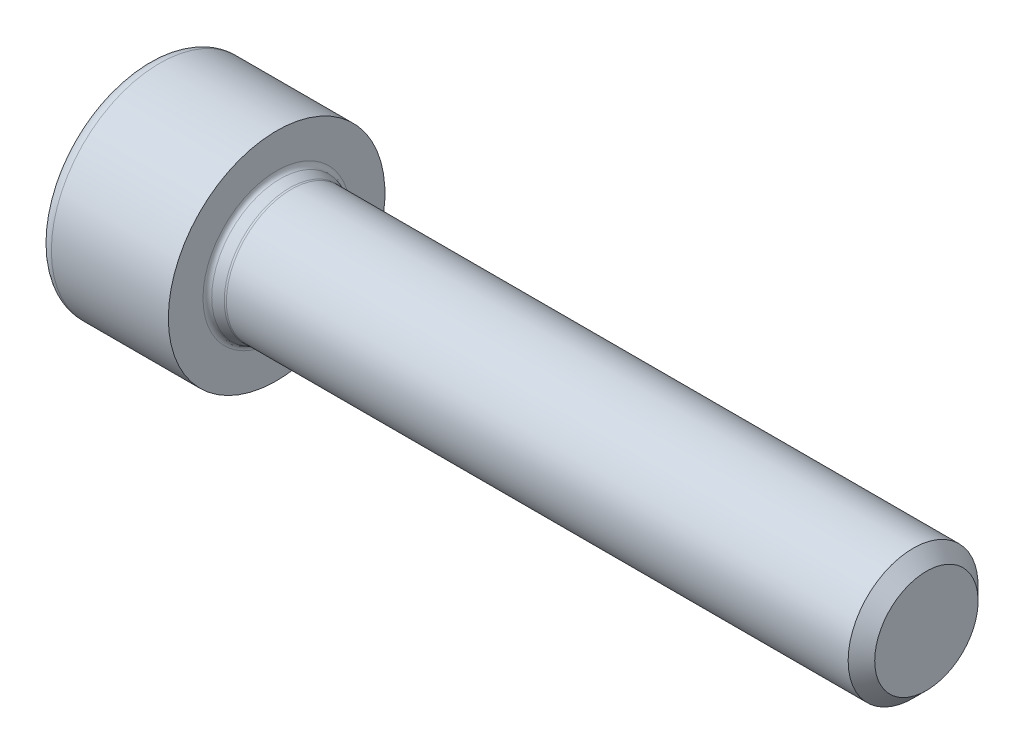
ISO-10303-21;
HEADER;
FILE_DESCRIPTION(('STEP AP214'),'2;1');
FILE_NAME('part.step','',(''),(''),'','','');
FILE_SCHEMA(('AUTOMOTIVE_DESIGN { 1 0 10303 214 1 1 1 1 }'));
ENDSEC;
DATA;
#1=APPLICATION_CONTEXT('core data for automotive mechanical design processes');
#2=APPLICATION_PROTOCOL_DEFINITION('international standard','automotive_design',2000,#1);
#3=PRODUCT_CONTEXT('',#1,'mechanical');
#4=PRODUCT('Part','Part','',(#3));
#5=PRODUCT_RELATED_PRODUCT_CATEGORY('part','',(#4));
#6=PRODUCT_DEFINITION_FORMATION('','',#4);
#7=PRODUCT_DEFINITION_CONTEXT('part definition',#1,'design');
#8=PRODUCT_DEFINITION('design','',#6,#7);
#9=PRODUCT_DEFINITION_SHAPE('','',#8);
#10=(LENGTH_UNIT() NAMED_UNIT(*) SI_UNIT(.MILLI.,.METRE.));
#11=(NAMED_UNIT(*) PLANE_ANGLE_UNIT() SI_UNIT($,.RADIAN.));
#12=(NAMED_UNIT(*) SI_UNIT($,.STERADIAN.) SOLID_ANGLE_UNIT());
#13=UNCERTAINTY_MEASURE_WITH_UNIT(LENGTH_MEASURE(1.E-05),#10,'distance_accuracy_value','');
#14=(GEOMETRIC_REPRESENTATION_CONTEXT(3) GLOBAL_UNCERTAINTY_ASSIGNED_CONTEXT((#13)) GLOBAL_UNIT_ASSIGNED_CONTEXT((#10,
#11,#12)) REPRESENTATION_CONTEXT('',''));
#15=CARTESIAN_POINT('',(0.,0.,0.));
#16=DIRECTION('',(0.,0.,1.));
#17=DIRECTION('',(1.,0.,0.));
#18=AXIS2_PLACEMENT_3D('',#15,#16,#17);
#19=CARTESIAN_POINT('',(-6.,0.,0.));
#20=DIRECTION('',(-1.,0.,0.));
#21=DIRECTION('',(0.,0.,1.));
#22=AXIS2_PLACEMENT_3D('',#19,#20,#21);
#23=CONICAL_SURFACE('',#22,2.86000000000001,0.785398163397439);
#24=CARTESIAN_POINT('',(-6.,0.,0.));
#25=DIRECTION('',(-1.,0.,0.));
#26=DIRECTION('',(0.,0.,1.));
#27=AXIS2_PLACEMENT_3D('',#24,#25,#26);
#28=CIRCLE('',#27,2.86000000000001);
#29=CARTESIAN_POINT('',(-6.,1.47051329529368,2.45299625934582));
#30=VERTEX_POINT('',#29);
#31=CARTESIAN_POINT('',(-6.,2.85961372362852,0.0470037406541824));
#32=VERTEX_POINT('',#31);
#33=EDGE_CURVE('E277',#30,#32,#28,.T.);
#34=ORIENTED_EDGE('',*,*,#33,.T.);
#35=CARTESIAN_POINT('',(-6.0002,2.85981958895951,0.0466471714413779));
#36=CARTESIAN_POINT('',(-5.9535581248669,2.8117797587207,0.129854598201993));
#37=CARTESIAN_POINT('',(-5.90977996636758,2.76295285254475,0.214425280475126));
#38=CARTESIAN_POINT('',(-5.82984876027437,2.66348007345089,0.386717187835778));
#39=CARTESIAN_POINT('',(-5.79373670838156,2.61282603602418,0.474452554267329));
#40=CARTESIAN_POINT('',(-5.73201914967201,2.51070463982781,0.651332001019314));
#41=CARTESIAN_POINT('',(-5.70626836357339,2.45925985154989,0.740436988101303));
#42=CARTESIAN_POINT('',(-5.66674232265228,2.35531480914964,0.920475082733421));
#43=CARTESIAN_POINT('',(-5.65294024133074,2.30281719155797,1.01140362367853));
#44=CARTESIAN_POINT('',(-5.64046950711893,2.21102353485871,1.17039490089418));
#45=CARTESIAN_POINT('',(-5.63880967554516,2.17182546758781,1.23828794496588));
#46=CARTESIAN_POINT('',(-5.6428692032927,2.09351034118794,1.37393372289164));
#47=CARTESIAN_POINT('',(-5.64859105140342,2.05439331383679,1.44168640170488));
#48=CARTESIAN_POINT('',(-5.66708669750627,1.9765471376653,1.57651993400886));
#49=CARTESIAN_POINT('',(-5.67986731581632,1.93781840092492,1.64360007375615));
#50=CARTESIAN_POINT('',(-5.71178546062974,1.86103794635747,1.77658772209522));
#51=CARTESIAN_POINT('',(-5.73092243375,1.82298616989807,1.84249533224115));
#52=CARTESIAN_POINT('',(-5.78438808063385,1.73101321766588,2.00179715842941));
#53=CARTESIAN_POINT('',(-5.82169163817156,1.67752371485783,2.09444369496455));
#54=CARTESIAN_POINT('',(-5.88419452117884,1.59873239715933,2.23091426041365));
#55=CARTESIAN_POINT('',(-5.90608259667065,1.57274677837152,2.27592267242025));
#56=CARTESIAN_POINT('',(-5.95177212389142,1.52121042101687,2.36518626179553));
#57=CARTESIAN_POINT('',(-5.9755728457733,1.49565952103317,2.40944171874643));
#58=CARTESIAN_POINT('',(-6.00020000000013,1.47030742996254,2.45335282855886));
#59=B_SPLINE_CURVE_WITH_KNOTS('',3,(#35,#36,#37,#38,#39,#40,#41,#42,#43,#44,#45,#46,#47,#48,#49,
#50,#51,#52,#53,#54,#55,#56,#57,#58),.UNSPECIFIED.,.F.,.F.,(4,2,2,2,2,2,2,2,2,2,2,4),(0.,
0.320611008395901,0.642895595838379,0.960489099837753,1.2773676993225,1.51227477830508,
1.74726107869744,1.98247482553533,2.21766810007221,2.55697541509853,2.72612555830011,
2.89521145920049),.UNSPECIFIED.);
#60=EDGE_CURVE('E242',#32,#30,#59,.T.);
#61=ORIENTED_EDGE('',*,*,#60,.T.);
#62=EDGE_LOOP('',(#34,#61));
#63=FACE_BOUND('',#62,.T.);
#64=ADVANCED_FACE('F32',(#63),#23,.F.);
#65=CARTESIAN_POINT('',(-6.,2.85961372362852,-0.0470037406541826));
#66=VERTEX_POINT('',#65);
#67=CARTESIAN_POINT('',(-6.,1.47051329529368,-2.45299625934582));
#68=VERTEX_POINT('',#67);
#69=EDGE_CURVE('E280',#66,#68,#28,.T.);
#70=ORIENTED_EDGE('',*,*,#69,.T.);
#71=CARTESIAN_POINT('',(-6.00020000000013,1.47030742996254,-2.45335282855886));
#72=CARTESIAN_POINT('',(-5.95355812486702,1.51834726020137,-2.37014540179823));
#73=CARTESIAN_POINT('',(-5.90977996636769,1.56717416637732,-2.28557471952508));
#74=CARTESIAN_POINT('',(-5.82984876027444,1.6666469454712,-2.1132828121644));
#75=CARTESIAN_POINT('',(-5.79373670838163,1.71730098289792,-2.02554744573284));
#76=CARTESIAN_POINT('',(-5.73201914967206,1.8194223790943,-1.84866799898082));
#77=CARTESIAN_POINT('',(-5.70626836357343,1.87086716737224,-1.75956301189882));
#78=CARTESIAN_POINT('',(-5.66674232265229,1.9748122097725,-1.57952491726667));
#79=CARTESIAN_POINT('',(-5.65294024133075,2.02730982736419,-1.48859637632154));
#80=CARTESIAN_POINT('',(-5.64046950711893,2.11910348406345,-1.32960509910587));
#81=CARTESIAN_POINT('',(-5.63880967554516,2.15830155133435,-1.26171205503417));
#82=CARTESIAN_POINT('',(-5.6428692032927,2.23661667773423,-1.12606627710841));
#83=CARTESIAN_POINT('',(-5.64859105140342,2.27573370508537,-1.05831359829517));
#84=CARTESIAN_POINT('',(-5.66708669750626,2.35357988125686,-0.923480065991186));
#85=CARTESIAN_POINT('',(-5.67986731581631,2.39230861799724,-0.856399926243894));
#86=CARTESIAN_POINT('',(-5.71178546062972,2.4690890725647,-0.723412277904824));
#87=CARTESIAN_POINT('',(-5.73092243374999,2.50714084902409,-0.657504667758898));
#88=CARTESIAN_POINT('',(-5.78438808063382,2.59911380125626,-0.498202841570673));
#89=CARTESIAN_POINT('',(-5.82169163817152,2.6526033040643,-0.405556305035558));
#90=CARTESIAN_POINT('',(-5.88419452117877,2.73139462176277,-0.269085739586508));
#91=CARTESIAN_POINT('',(-5.90608259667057,2.75738024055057,-0.224077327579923));
#92=CARTESIAN_POINT('',(-5.95177212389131,2.8089165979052,-0.134813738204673));
#93=CARTESIAN_POINT('',(-5.97557284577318,2.8344674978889,-0.0905582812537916));
#94=CARTESIAN_POINT('',(-6.0002,2.85981958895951,-0.0466471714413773));
#95=B_SPLINE_CURVE_WITH_KNOTS('',3,(#71,#72,#73,#74,#75,#76,#77,#78,#79,#80,#81,#82,#83,#84,#85,
#86,#87,#88,#89,#90,#91,#92,#93,#94),.UNSPECIFIED.,.F.,.F.,(4,2,2,2,2,2,2,2,2,2,2,4),(0.,
0.32061100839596,0.642895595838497,0.960489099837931,1.27736769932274,1.51227477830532,
1.74726107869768,1.98247482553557,2.21766810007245,2.55697541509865,2.72612555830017,
2.89521145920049),.UNSPECIFIED.);
#96=EDGE_CURVE('E237',#68,#66,#95,.T.);
#97=ORIENTED_EDGE('',*,*,#96,.T.);
#98=EDGE_LOOP('',(#70,#97));
#99=FACE_BOUND('',#98,.T.);
#100=ADVANCED_FACE('F268',(#99),#23,.F.);
#101=CARTESIAN_POINT('',(-6.,1.38910042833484,-2.5));
#102=VERTEX_POINT('',#101);
#103=CARTESIAN_POINT('',(-6.,-1.38910042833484,-2.5));
#104=VERTEX_POINT('',#103);
#105=EDGE_CURVE('E286',#102,#104,#28,.T.);
#106=ORIENTED_EDGE('',*,*,#105,.T.);
#107=CARTESIAN_POINT('',(-7.04621429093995,-3.00141801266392,-2.5));
#108=CARTESIAN_POINT('',(-6.99047801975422,-2.9288633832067,-2.5));
#109=CARTESIAN_POINT('',(-6.9352441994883,-2.85591659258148,-2.5));
#110=CARTESIAN_POINT('',(-6.82601065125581,-2.70907883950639,-2.5));
#111=CARTESIAN_POINT('',(-6.77201121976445,-2.63518765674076,-2.5));
#112=CARTESIAN_POINT('',(-6.66509132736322,-2.48576117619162,-2.5));
#113=CARTESIAN_POINT('',(-6.61218241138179,-2.41021759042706,-2.5));
#114=CARTESIAN_POINT('',(-6.5082160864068,-2.25787105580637,-2.5));
#115=CARTESIAN_POINT('',(-6.45715854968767,-2.18106819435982,-2.5));
#116=CARTESIAN_POINT('',(-6.3541679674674,-2.02110271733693,-2.5));
#117=CARTESIAN_POINT('',(-6.30238273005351,-1.93784445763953,-2.5));
#118=CARTESIAN_POINT('',(-6.20205686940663,-1.76939822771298,-2.5));
#119=CARTESIAN_POINT('',(-6.15351582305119,-1.6842105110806,-2.5));
#120=CARTESIAN_POINT('',(-6.06068920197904,-1.51184789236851,-2.5));
#121=CARTESIAN_POINT('',(-6.01639172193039,-1.42467945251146,-2.5));
#122=CARTESIAN_POINT('',(-5.93305281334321,-1.24788511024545,-2.5));
#123=CARTESIAN_POINT('',(-5.89400891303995,-1.15826038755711,-2.5));
#124=CARTESIAN_POINT('',(-5.82606501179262,-0.985211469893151,-2.5));
#125=CARTESIAN_POINT('',(-5.79654772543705,-0.902032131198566,-2.5));
#126=CARTESIAN_POINT('',(-5.74417210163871,-0.733563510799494,-2.5));
#127=CARTESIAN_POINT('',(-5.72131419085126,-0.648274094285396,-2.5));
#128=CARTESIAN_POINT('',(-5.6838718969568,-0.477574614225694,-2.5));
#129=CARTESIAN_POINT('',(-5.66913793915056,-0.392197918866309,-2.5));
#130=CARTESIAN_POINT('',(-5.6482493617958,-0.220395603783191,-2.5));
#131=CARTESIAN_POINT('',(-5.64209298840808,-0.133970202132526,-2.5));
#132=CARTESIAN_POINT('',(-5.63887861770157,0.0353261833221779,-2.5));
#133=CARTESIAN_POINT('',(-5.64144035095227,0.118190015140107,-2.5));
#134=CARTESIAN_POINT('',(-5.65465041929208,0.283265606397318,-2.5));
#135=CARTESIAN_POINT('',(-5.66529949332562,0.365477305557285,-2.5));
#136=CARTESIAN_POINT('',(-5.69426404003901,0.530049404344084,-2.5));
#137=CARTESIAN_POINT('',(-5.71271446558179,0.612385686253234,-2.5));
#138=CARTESIAN_POINT('',(-5.7562642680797,0.775238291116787,-2.5));
#139=CARTESIAN_POINT('',(-5.78136325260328,0.85575472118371,-2.5));
#140=CARTESIAN_POINT('',(-5.86831710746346,1.1039679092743,-2.5));
#141=CARTESIAN_POINT('',(-5.93984988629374,1.2682852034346,-2.5));
#142=CARTESIAN_POINT('',(-6.05916987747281,1.50877129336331,-2.5));
#143=CARTESIAN_POINT('',(-6.10103936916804,1.58808256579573,-2.5));
#144=CARTESIAN_POINT('',(-6.18802346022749,1.74490949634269,-2.5));
#145=CARTESIAN_POINT('',(-6.23313748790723,1.82242546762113,-2.5));
#146=CARTESIAN_POINT('',(-6.32366670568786,1.97208112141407,-2.5));
#147=CARTESIAN_POINT('',(-6.3689569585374,2.04429724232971,-2.5));
#148=CARTESIAN_POINT('',(-6.46146491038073,2.18749040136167,-2.5));
#149=CARTESIAN_POINT('',(-6.50868275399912,2.25846734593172,-2.5));
#150=CARTESIAN_POINT('',(-6.60431609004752,2.39877145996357,-2.5));
#151=CARTESIAN_POINT('',(-6.6527189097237,2.46810730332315,-2.5));
#152=CARTESIAN_POINT('',(-6.75082091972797,2.6058280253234,-2.5));
#153=CARTESIAN_POINT('',(-6.80051974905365,2.67421316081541,-2.5));
#154=CARTESIAN_POINT('',(-6.85074916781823,2.74219973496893,-2.5));
#155=B_SPLINE_CURVE_WITH_KNOTS('',3,(#107,#108,#109,#110,#111,#112,#113,#114,#115,#116,#117,
#118,#119,#120,#121,#122,#123,#124,#125,#126,#127,#128,#129,#130,#131,#132,#133,#134,#135,#136,
#137,#138,#139,#140,#141,#142,#143,#144,#145,#146,#147,#148,#149,#150,#151,#152,#153,#154),
.UNSPECIFIED.,.F.,.F.,(4,2,2,2,2,2,2,2,2,2,2,2,2,2,2,2,2,2,2,2,2,2,2,4),(0.,0.274479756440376,
0.549024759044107,0.825688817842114,1.10233375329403,1.39642312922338,1.69047407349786,
1.98367429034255,2.27673607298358,2.54129169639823,2.80586426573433,3.06538746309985,
3.32485758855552,3.57315770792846,3.82148051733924,4.07428704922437,4.3270786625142,
4.86305553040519,5.13208661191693,5.40107040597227,5.65676835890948,5.91248553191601,
6.16614786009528,6.41974027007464),.UNSPECIFIED.);
#156=EDGE_CURVE('E231',#104,#102,#155,.T.);
#157=ORIENTED_EDGE('',*,*,#156,.T.);
#158=EDGE_LOOP('',(#106,#157));
#159=FACE_BOUND('',#158,.T.);
#160=ADVANCED_FACE('F273',(#159),#23,.F.);
#161=CARTESIAN_POINT('',(-6.,-1.47051329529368,-2.45299625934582));
#162=VERTEX_POINT('',#161);
#163=CARTESIAN_POINT('',(-6.,-2.85961372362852,-0.0470037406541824));
#164=VERTEX_POINT('',#163);
#165=EDGE_CURVE('E293',#162,#164,#28,.T.);
#166=ORIENTED_EDGE('',*,*,#165,.T.);
#167=CARTESIAN_POINT('',(-6.0002,-2.85981958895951,-0.0466471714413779));
#168=CARTESIAN_POINT('',(-5.9535581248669,-2.8117797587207,-0.129854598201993));
#169=CARTESIAN_POINT('',(-5.90977996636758,-2.76295285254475,-0.214425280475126));
#170=CARTESIAN_POINT('',(-5.82984876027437,-2.66348007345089,-0.386717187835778));
#171=CARTESIAN_POINT('',(-5.79373670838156,-2.61282603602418,-0.474452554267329));
#172=CARTESIAN_POINT('',(-5.73201914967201,-2.51070463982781,-0.651332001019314));
#173=CARTESIAN_POINT('',(-5.70626836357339,-2.45925985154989,-0.740436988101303));
#174=CARTESIAN_POINT('',(-5.66674232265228,-2.35531480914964,-0.920475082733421));
#175=CARTESIAN_POINT('',(-5.65294024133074,-2.30281719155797,-1.01140362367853));
#176=CARTESIAN_POINT('',(-5.64046950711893,-2.21102353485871,-1.17039490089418));
#177=CARTESIAN_POINT('',(-5.63880967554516,-2.17182546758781,-1.23828794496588));
#178=CARTESIAN_POINT('',(-5.6428692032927,-2.09351034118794,-1.37393372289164));
#179=CARTESIAN_POINT('',(-5.64859105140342,-2.05439331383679,-1.44168640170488));
#180=CARTESIAN_POINT('',(-5.66708669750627,-1.9765471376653,-1.57651993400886));
#181=CARTESIAN_POINT('',(-5.67986731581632,-1.93781840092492,-1.64360007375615));
#182=CARTESIAN_POINT('',(-5.71178546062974,-1.86103794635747,-1.77658772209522));
#183=CARTESIAN_POINT('',(-5.73092243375,-1.82298616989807,-1.84249533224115));
#184=CARTESIAN_POINT('',(-5.78438808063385,-1.73101321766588,-2.00179715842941));
#185=CARTESIAN_POINT('',(-5.82169163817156,-1.67752371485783,-2.09444369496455));
#186=CARTESIAN_POINT('',(-5.88419452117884,-1.59873239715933,-2.23091426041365));
#187=CARTESIAN_POINT('',(-5.90608259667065,-1.57274677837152,-2.27592267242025));
#188=CARTESIAN_POINT('',(-5.95177212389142,-1.52121042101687,-2.36518626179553));
#189=CARTESIAN_POINT('',(-5.9755728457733,-1.49565952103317,-2.40944171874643));
#190=CARTESIAN_POINT('',(-6.00020000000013,-1.47030742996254,-2.45335282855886));
#191=B_SPLINE_CURVE_WITH_KNOTS('',3,(#167,#168,#169,#170,#171,#172,#173,#174,#175,#176,#177,
#178,#179,#180,#181,#182,#183,#184,#185,#186,#187,#188,#189,#190),.UNSPECIFIED.,.F.,.F.,(4,2,2,
2,2,2,2,2,2,2,2,4),(0.,0.320611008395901,0.642895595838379,0.960489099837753,1.2773676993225,
1.51227477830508,1.74726107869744,1.98247482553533,2.21766810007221,2.55697541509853,
2.72612555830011,2.89521145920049),.UNSPECIFIED.);
#192=EDGE_CURVE('E225',#164,#162,#191,.T.);
#193=ORIENTED_EDGE('',*,*,#192,.T.);
#194=EDGE_LOOP('',(#166,#193));
#195=FACE_BOUND('',#194,.T.);
#196=ADVANCED_FACE('F460',(#195),#23,.F.);
#197=CARTESIAN_POINT('',(-6.,-2.85961372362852,0.0470037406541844));
#198=VERTEX_POINT('',#197);
#199=CARTESIAN_POINT('',(-6.,-1.47051329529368,2.45299625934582));
#200=VERTEX_POINT('',#199);
#201=EDGE_CURVE('E289',#198,#200,#28,.T.);
#202=ORIENTED_EDGE('',*,*,#201,.T.);
#203=CARTESIAN_POINT('',(-6.00020000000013,-1.47030742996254,2.45335282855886));
#204=CARTESIAN_POINT('',(-5.95355812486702,-1.51834726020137,2.37014540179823));
#205=CARTESIAN_POINT('',(-5.90977996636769,-1.56717416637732,2.28557471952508));
#206=CARTESIAN_POINT('',(-5.82984876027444,-1.6666469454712,2.1132828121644));
#207=CARTESIAN_POINT('',(-5.79373670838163,-1.71730098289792,2.02554744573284));
#208=CARTESIAN_POINT('',(-5.73201914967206,-1.8194223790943,1.84866799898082));
#209=CARTESIAN_POINT('',(-5.70626836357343,-1.87086716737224,1.75956301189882));
#210=CARTESIAN_POINT('',(-5.66674232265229,-1.9748122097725,1.57952491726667));
#211=CARTESIAN_POINT('',(-5.65294024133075,-2.02730982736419,1.48859637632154));
#212=CARTESIAN_POINT('',(-5.64046950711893,-2.11910348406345,1.32960509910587));
#213=CARTESIAN_POINT('',(-5.63880967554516,-2.15830155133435,1.26171205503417));
#214=CARTESIAN_POINT('',(-5.6428692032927,-2.23661667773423,1.12606627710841));
#215=CARTESIAN_POINT('',(-5.64859105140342,-2.27573370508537,1.05831359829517));
#216=CARTESIAN_POINT('',(-5.66708669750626,-2.35357988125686,0.923480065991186));
#217=CARTESIAN_POINT('',(-5.67986731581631,-2.39230861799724,0.856399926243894));
#218=CARTESIAN_POINT('',(-5.71178546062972,-2.4690890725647,0.723412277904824));
#219=CARTESIAN_POINT('',(-5.73092243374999,-2.50714084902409,0.657504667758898));
#220=CARTESIAN_POINT('',(-5.78438808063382,-2.59911380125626,0.498202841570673));
#221=CARTESIAN_POINT('',(-5.82169163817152,-2.6526033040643,0.405556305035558));
#222=CARTESIAN_POINT('',(-5.88419452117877,-2.73139462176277,0.269085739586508));
#223=CARTESIAN_POINT('',(-5.90608259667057,-2.75738024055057,0.224077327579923));
#224=CARTESIAN_POINT('',(-5.95177212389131,-2.8089165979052,0.134813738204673));
#225=CARTESIAN_POINT('',(-5.97557284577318,-2.8344674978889,0.0905582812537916));
#226=CARTESIAN_POINT('',(-6.0002,-2.85981958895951,0.0466471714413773));
#227=B_SPLINE_CURVE_WITH_KNOTS('',3,(#203,#204,#205,#206,#207,#208,#209,#210,#211,#212,#213,
#214,#215,#216,#217,#218,#219,#220,#221,#222,#223,#224,#225,#226),.UNSPECIFIED.,.F.,.F.,(4,2,2,
2,2,2,2,2,2,2,2,4),(0.,0.32061100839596,0.642895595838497,0.960489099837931,1.27736769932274,
1.51227477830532,1.74726107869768,1.98247482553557,2.21766810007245,2.55697541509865,
2.72612555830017,2.89521145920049),.UNSPECIFIED.);
#228=EDGE_CURVE('E203',#200,#198,#227,.T.);
#229=ORIENTED_EDGE('',*,*,#228,.T.);
#230=EDGE_LOOP('',(#202,#229));
#231=FACE_BOUND('',#230,.T.);
#232=ADVANCED_FACE('F216',(#231),#23,.F.);
#233=CARTESIAN_POINT('',(-6.,-1.38910042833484,2.5));
#234=VERTEX_POINT('',#233);
#235=CARTESIAN_POINT('',(-6.,1.38910042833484,2.5));
#236=VERTEX_POINT('',#235);
#237=EDGE_CURVE('E282',#234,#236,#28,.T.);
#238=ORIENTED_EDGE('',*,*,#237,.T.);
#239=CARTESIAN_POINT('',(-7.04621429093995,-3.00141801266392,2.5));
#240=CARTESIAN_POINT('',(-6.99047801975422,-2.9288633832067,2.5));
#241=CARTESIAN_POINT('',(-6.9352441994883,-2.85591659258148,2.5));
#242=CARTESIAN_POINT('',(-6.82601065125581,-2.70907883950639,2.5));
#243=CARTESIAN_POINT('',(-6.77201121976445,-2.63518765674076,2.5));
#244=CARTESIAN_POINT('',(-6.66509132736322,-2.48576117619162,2.5));
#245=CARTESIAN_POINT('',(-6.61218241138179,-2.41021759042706,2.5));
#246=CARTESIAN_POINT('',(-6.5082160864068,-2.25787105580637,2.5));
#247=CARTESIAN_POINT('',(-6.45715854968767,-2.18106819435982,2.5));
#248=CARTESIAN_POINT('',(-6.3541679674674,-2.02110271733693,2.5));
#249=CARTESIAN_POINT('',(-6.30238273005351,-1.93784445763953,2.5));
#250=CARTESIAN_POINT('',(-6.20205686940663,-1.76939822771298,2.5));
#251=CARTESIAN_POINT('',(-6.15351582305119,-1.6842105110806,2.5));
#252=CARTESIAN_POINT('',(-6.06068920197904,-1.51184789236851,2.5));
#253=CARTESIAN_POINT('',(-6.01639172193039,-1.42467945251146,2.5));
#254=CARTESIAN_POINT('',(-5.93305281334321,-1.24788511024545,2.5));
#255=CARTESIAN_POINT('',(-5.89400891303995,-1.15826038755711,2.5));
#256=CARTESIAN_POINT('',(-5.82606501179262,-0.985211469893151,2.5));
#257=CARTESIAN_POINT('',(-5.79654772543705,-0.902032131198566,2.5));
#258=CARTESIAN_POINT('',(-5.74417210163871,-0.733563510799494,2.5));
#259=CARTESIAN_POINT('',(-5.72131419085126,-0.648274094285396,2.5));
#260=CARTESIAN_POINT('',(-5.6838718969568,-0.477574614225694,2.5));
#261=CARTESIAN_POINT('',(-5.66913793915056,-0.392197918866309,2.5));
#262=CARTESIAN_POINT('',(-5.6482493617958,-0.220395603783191,2.5));
#263=CARTESIAN_POINT('',(-5.64209298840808,-0.133970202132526,2.5));
#264=CARTESIAN_POINT('',(-5.63887861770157,0.0353261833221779,2.5));
#265=CARTESIAN_POINT('',(-5.64144035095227,0.118190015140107,2.5));
#266=CARTESIAN_POINT('',(-5.65465041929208,0.283265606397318,2.5));
#267=CARTESIAN_POINT('',(-5.66529949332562,0.365477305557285,2.5));
#268=CARTESIAN_POINT('',(-5.69426404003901,0.530049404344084,2.5));
#269=CARTESIAN_POINT('',(-5.71271446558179,0.612385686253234,2.5));
#270=CARTESIAN_POINT('',(-5.7562642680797,0.775238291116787,2.5));
#271=CARTESIAN_POINT('',(-5.78136325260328,0.85575472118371,2.5));
#272=CARTESIAN_POINT('',(-5.86831710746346,1.1039679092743,2.5));
#273=CARTESIAN_POINT('',(-5.93984988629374,1.2682852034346,2.5));
#274=CARTESIAN_POINT('',(-6.05916987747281,1.50877129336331,2.5));
#275=CARTESIAN_POINT('',(-6.10103936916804,1.58808256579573,2.5));
#276=CARTESIAN_POINT('',(-6.18802346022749,1.74490949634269,2.5));
#277=CARTESIAN_POINT('',(-6.23313748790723,1.82242546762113,2.5));
#278=CARTESIAN_POINT('',(-6.32366670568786,1.97208112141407,2.5));
#279=CARTESIAN_POINT('',(-6.3689569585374,2.04429724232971,2.5));
#280=CARTESIAN_POINT('',(-6.46146491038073,2.18749040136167,2.5));
#281=CARTESIAN_POINT('',(-6.50868275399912,2.25846734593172,2.5));
#282=CARTESIAN_POINT('',(-6.60431609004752,2.39877145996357,2.5));
#283=CARTESIAN_POINT('',(-6.6527189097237,2.46810730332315,2.5));
#284=CARTESIAN_POINT('',(-6.75082091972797,2.6058280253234,2.5));
#285=CARTESIAN_POINT('',(-6.80051974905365,2.67421316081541,2.5));
#286=CARTESIAN_POINT('',(-6.85074916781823,2.74219973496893,2.5));
#287=B_SPLINE_CURVE_WITH_KNOTS('',3,(#239,#240,#241,#242,#243,#244,#245,#246,#247,#248,#249,
#250,#251,#252,#253,#254,#255,#256,#257,#258,#259,#260,#261,#262,#263,#264,#265,#266,#267,#268,
#269,#270,#271,#272,#273,#274,#275,#276,#277,#278,#279,#280,#281,#282,#283,#284,#285,#286),
.UNSPECIFIED.,.F.,.F.,(4,2,2,2,2,2,2,2,2,2,2,2,2,2,2,2,2,2,2,2,2,2,2,4),(0.,0.274479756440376,
0.549024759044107,0.825688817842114,1.10233375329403,1.39642312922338,1.69047407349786,
1.98367429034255,2.27673607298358,2.54129169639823,2.80586426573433,3.06538746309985,
3.32485758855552,3.57315770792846,3.82148051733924,4.07428704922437,4.3270786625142,
4.86305553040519,5.13208661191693,5.40107040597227,5.65676835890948,5.91248553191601,
6.16614786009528,6.41974027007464),.UNSPECIFIED.);
#288=EDGE_CURVE('E190',#236,#234,#287,.F.);
#289=ORIENTED_EDGE('',*,*,#288,.T.);
#290=EDGE_LOOP('',(#238,#289));
#291=FACE_BOUND('',#290,.T.);
#292=ADVANCED_FACE('F211',(#291),#23,.F.);
#293=CARTESIAN_POINT('',(-6.,0.,-2.86000000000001));
#294=DIRECTION('',(1.,0.,0.));
#295=DIRECTION('',(0.,0.,-1.));
#296=AXIS2_PLACEMENT_3D('',#293,#294,#295);
#297=PLANE('',#296);
#298=DIRECTION('',(0.,0.5,0.866025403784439));
#299=VECTOR('',#298,1.);
#300=CARTESIAN_POINT('',(-6.,0.926647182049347,-3.395));
#301=LINE('',#300,#299);
#302=CARTESIAN_POINT('',(-6.,2.88675134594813,0.));
#303=VERTEX_POINT('',#302);
#304=EDGE_CURVE('E41',#66,#303,#301,.T.);
#305=ORIENTED_EDGE('',*,*,#304,.T.);
#306=DIRECTION('',(0.,-0.5,0.866025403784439));
#307=VECTOR('',#306,1.);
#308=CARTESIAN_POINT('',(-6.,3.40347983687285,-0.895000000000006));
#309=LINE('',#308,#307);
#310=EDGE_CURVE('E11',#303,#32,#309,.T.);
#311=ORIENTED_EDGE('',*,*,#310,.T.);
#312=ORIENTED_EDGE('',*,*,#33,.F.);
#313=CARTESIAN_POINT('',(-6.,1.44337567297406,2.5));
#314=VERTEX_POINT('',#313);
#315=EDGE_CURVE('E43',#30,#314,#309,.T.);
#316=ORIENTED_EDGE('',*,*,#315,.T.);
#317=DIRECTION('',(0.,-1.,0.));
#318=VECTOR('',#317,1.);
#319=CARTESIAN_POINT('',(-6.,0.,2.5));
#320=LINE('',#319,#318);
#321=EDGE_CURVE('E165',#314,#236,#320,.T.);
#322=ORIENTED_EDGE('',*,*,#321,.T.);
#323=ORIENTED_EDGE('',*,*,#237,.F.);
#324=CARTESIAN_POINT('',(-6.,-1.44337567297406,2.5));
#325=VERTEX_POINT('',#324);
#326=EDGE_CURVE('E403',#234,#325,#320,.T.);
#327=ORIENTED_EDGE('',*,*,#326,.T.);
#328=DIRECTION('',(0.,-0.5,-0.866025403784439));
#329=VECTOR('',#328,1.);
#330=CARTESIAN_POINT('',(-6.,-3.40347983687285,-0.895000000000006));
#331=LINE('',#330,#329);
#332=EDGE_CURVE('E400',#325,#200,#331,.T.);
#333=ORIENTED_EDGE('',*,*,#332,.T.);
#334=ORIENTED_EDGE('',*,*,#201,.F.);
#335=CARTESIAN_POINT('',(-6.,-2.88675134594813,0.));
#336=VERTEX_POINT('',#335);
#337=EDGE_CURVE('E398',#198,#336,#331,.T.);
#338=ORIENTED_EDGE('',*,*,#337,.T.);
#339=DIRECTION('',(0.,0.5,-0.866025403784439));
#340=VECTOR('',#339,1.);
#341=CARTESIAN_POINT('',(-6.,-0.926647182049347,-3.395));
#342=LINE('',#341,#340);
#343=EDGE_CURVE('E396',#336,#164,#342,.T.);
#344=ORIENTED_EDGE('',*,*,#343,.T.);
#345=ORIENTED_EDGE('',*,*,#165,.F.);
#346=CARTESIAN_POINT('',(-6.,-1.44337567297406,-2.5));
#347=VERTEX_POINT('',#346);
#348=EDGE_CURVE('E394',#162,#347,#342,.T.);
#349=ORIENTED_EDGE('',*,*,#348,.T.);
#350=DIRECTION('',(0.,1.,0.));
#351=VECTOR('',#350,1.);
#352=CARTESIAN_POINT('',(-6.,0.,-2.5));
#353=LINE('',#352,#351);
#354=EDGE_CURVE('E390',#347,#104,#353,.T.);
#355=ORIENTED_EDGE('',*,*,#354,.T.);
#356=ORIENTED_EDGE('',*,*,#105,.F.);
#357=CARTESIAN_POINT('',(-6.,1.44337567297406,-2.5));
#358=VERTEX_POINT('',#357);
#359=EDGE_CURVE('E388',#102,#358,#353,.T.);
#360=ORIENTED_EDGE('',*,*,#359,.T.);
#361=EDGE_CURVE('E36',#358,#68,#301,.T.);
#362=ORIENTED_EDGE('',*,*,#361,.T.);
#363=ORIENTED_EDGE('',*,*,#69,.F.);
#364=EDGE_LOOP('',(#305,#311,#312,#316,#322,#323,#327,#333,#334,#338,#344,#345,#349,#355,#356,
#360,#362,#363));
#365=FACE_BOUND('',#364,.T.);
#366=CARTESIAN_POINT('',(-6.,0.,0.));
#367=DIRECTION('',(-1.,0.,0.));
#368=DIRECTION('',(0.,0.,1.));
#369=AXIS2_PLACEMENT_3D('',#366,#367,#368);
#370=CIRCLE('',#369,4.40000000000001);
#371=CARTESIAN_POINT('',(-6.,0.,4.40000000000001));
#372=VERTEX_POINT('',#371);
#373=EDGE_CURVE('E290',#372,#372,#370,.T.);
#374=ORIENTED_EDGE('',*,*,#373,.T.);
#375=EDGE_LOOP('',(#374));
#376=FACE_BOUND('',#375,.T.);
#377=ADVANCED_FACE('F215',(#365,#376),#297,.F.);
#378=CARTESIAN_POINT('',(-5.40000000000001,0.,0.));
#379=DIRECTION('',(-1.,0.,0.));
#380=DIRECTION('',(0.,0.,1.));
#381=AXIS2_PLACEMENT_3D('',#378,#379,#380);
#382=TOROIDAL_SURFACE('',#381,4.40000000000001,0.599999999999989);
#383=ORIENTED_EDGE('',*,*,#373,.F.);
#384=EDGE_LOOP('',(#383));
#385=FACE_BOUND('',#384,.T.);
#386=CARTESIAN_POINT('',(-5.4,0.,0.));
#387=DIRECTION('',(-1.,0.,0.));
#388=DIRECTION('',(0.,0.,1.));
#389=AXIS2_PLACEMENT_3D('',#386,#387,#388);
#390=CIRCLE('',#389,5.);
#391=CARTESIAN_POINT('',(-5.4,0.,5.));
#392=VERTEX_POINT('',#391);
#393=EDGE_CURVE('E295',#392,#392,#390,.T.);
#394=ORIENTED_EDGE('',*,*,#393,.T.);
#395=EDGE_LOOP('',(#394));
#396=FACE_BOUND('',#395,.T.);
#397=ADVANCED_FACE('F360',(#385,#396),#382,.T.);
#398=CARTESIAN_POINT('',(33.,0.,0.));
#399=DIRECTION('',(-1.,0.,0.));
#400=DIRECTION('',(0.,0.,1.));
#401=AXIS2_PLACEMENT_3D('',#398,#399,#400);
#402=CYLINDRICAL_SURFACE('',#401,5.);
#403=ORIENTED_EDGE('',*,*,#393,.F.);
#404=EDGE_LOOP('',(#403));
#405=FACE_BOUND('',#404,.T.);
#406=CARTESIAN_POINT('',(0.,0.,0.));
#407=DIRECTION('',(-1.,0.,0.));
#408=DIRECTION('',(0.,0.,1.));
#409=AXIS2_PLACEMENT_3D('',#406,#407,#408);
#410=CIRCLE('',#409,5.);
#411=CARTESIAN_POINT('',(0.,0.,5.));
#412=VERTEX_POINT('',#411);
#413=EDGE_CURVE('E299',#412,#412,#410,.T.);
#414=ORIENTED_EDGE('',*,*,#413,.T.);
#415=EDGE_LOOP('',(#414));
#416=FACE_BOUND('',#415,.T.);
#417=ADVANCED_FACE('F357',(#405,#416),#402,.T.);
#418=CARTESIAN_POINT('',(0.,0.,-5.));
#419=DIRECTION('',(-1.,0.,0.));
#420=DIRECTION('',(0.,0.,1.));
#421=AXIS2_PLACEMENT_3D('',#418,#419,#420);
#422=PLANE('',#421);
#423=ORIENTED_EDGE('',*,*,#413,.F.);
#424=EDGE_LOOP('',(#423));
#425=FACE_BOUND('',#424,.T.);
#426=CARTESIAN_POINT('',(0.,0.,0.));
#427=DIRECTION('',(-1.,0.,0.));
#428=DIRECTION('',(0.,0.,1.));
#429=AXIS2_PLACEMENT_3D('',#426,#427,#428);
#430=CIRCLE('',#429,3.4);
#431=CARTESIAN_POINT('',(0.,0.,3.4));
#432=VERTEX_POINT('',#431);
#433=EDGE_CURVE('E304',#432,#432,#430,.T.);
#434=ORIENTED_EDGE('',*,*,#433,.T.);
#435=EDGE_LOOP('',(#434));
#436=FACE_BOUND('',#435,.T.);
#437=ADVANCED_FACE('F353',(#425,#436),#422,.F.);
#438=CARTESIAN_POINT('',(0.25,0.,0.));
#439=DIRECTION('',(-1.,0.,0.));
#440=DIRECTION('',(0.,0.,1.));
#441=AXIS2_PLACEMENT_3D('',#438,#439,#440);
#442=TOROIDAL_SURFACE('',#441,3.4,0.25);
#443=ORIENTED_EDGE('',*,*,#433,.F.);
#444=EDGE_LOOP('',(#443));
#445=FACE_BOUND('',#444,.T.);
#446=CARTESIAN_POINT('',(0.167656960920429,0.,0.));
#447=DIRECTION('',(-1.,0.,0.));
#448=DIRECTION('',(0.,0.,1.));
#449=AXIS2_PLACEMENT_3D('',#446,#447,#448);
#450=CIRCLE('',#449,3.16394995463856);
#451=CARTESIAN_POINT('',(0.167656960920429,0.,3.16394995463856));
#452=VERTEX_POINT('',#451);
#453=EDGE_CURVE('E307',#452,#452,#450,.T.);
#454=ORIENTED_EDGE('',*,*,#453,.T.);
#455=EDGE_LOOP('',(#454));
#456=FACE_BOUND('',#455,.T.);
#457=ADVANCED_FACE('F349',(#445,#456),#442,.F.);
#458=CARTESIAN_POINT('',(0.597656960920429,0.,0.));
#459=DIRECTION('',(-1.,0.,0.));
#460=DIRECTION('',(0.,0.,1.));
#461=AXIS2_PLACEMENT_3D('',#458,#459,#460);
#462=CONICAL_SURFACE('',#461,3.01394995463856,0.335638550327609);
#463=ORIENTED_EDGE('',*,*,#453,.F.);
#464=EDGE_LOOP('',(#463));
#465=FACE_BOUND('',#464,.T.);
#466=CARTESIAN_POINT('',(0.597656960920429,0.,0.));
#467=DIRECTION('',(-1.,0.,0.));
#468=DIRECTION('',(0.,0.,1.));
#469=AXIS2_PLACEMENT_3D('',#466,#467,#468);
#470=CIRCLE('',#469,3.01394995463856);
#471=CARTESIAN_POINT('',(0.597656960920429,0.,3.01394995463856));
#472=VERTEX_POINT('',#471);
#473=EDGE_CURVE('E310',#472,#472,#470,.T.);
#474=ORIENTED_EDGE('',*,*,#473,.T.);
#475=EDGE_LOOP('',(#474));
#476=FACE_BOUND('',#475,.T.);
#477=ADVANCED_FACE('F345',(#465,#476),#462,.T.);
#478=CARTESIAN_POINT('',(0.680000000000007,0.,0.));
#479=DIRECTION('',(-1.,0.,0.));
#480=DIRECTION('',(0.,0.,1.));
#481=AXIS2_PLACEMENT_3D('',#478,#479,#480);
#482=TOROIDAL_SURFACE('',#481,3.25000000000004,0.250000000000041);
#483=ORIENTED_EDGE('',*,*,#473,.F.);
#484=EDGE_LOOP('',(#483));
#485=FACE_BOUND('',#484,.T.);
#486=CARTESIAN_POINT('',(0.68,0.,0.));
#487=DIRECTION('',(-1.,0.,0.));
#488=DIRECTION('',(0.,0.,1.));
#489=AXIS2_PLACEMENT_3D('',#486,#487,#488);
#490=CIRCLE('',#489,3.);
#491=CARTESIAN_POINT('',(0.68,0.,3.));
#492=VERTEX_POINT('',#491);
#493=EDGE_CURVE('E313',#492,#492,#490,.T.);
#494=ORIENTED_EDGE('',*,*,#493,.T.);
#495=EDGE_LOOP('',(#494));
#496=FACE_BOUND('',#495,.T.);
#497=ADVANCED_FACE('F341',(#485,#496),#482,.F.);
#498=CARTESIAN_POINT('',(33.,0.,0.));
#499=DIRECTION('',(-1.,0.,0.));
#500=DIRECTION('',(0.,0.,1.));
#501=AXIS2_PLACEMENT_3D('',#498,#499,#500);
#502=CYLINDRICAL_SURFACE('',#501,3.);
#503=ORIENTED_EDGE('',*,*,#493,.F.);
#504=EDGE_LOOP('',(#503));
#505=FACE_BOUND('',#504,.T.);
#506=CARTESIAN_POINT('',(29.3865,0.,0.));
#507=DIRECTION('',(-1.,0.,0.));
#508=DIRECTION('',(0.,0.,1.));
#509=AXIS2_PLACEMENT_3D('',#506,#507,#508);
#510=CIRCLE('',#509,3.);
#511=CARTESIAN_POINT('',(29.3865,0.,3.));
#512=VERTEX_POINT('',#511);
#513=EDGE_CURVE('E316',#512,#512,#510,.T.);
#514=ORIENTED_EDGE('',*,*,#513,.T.);
#515=EDGE_LOOP('',(#514));
#516=FACE_BOUND('',#515,.T.);
#517=ADVANCED_FACE('F334',(#505,#516),#502,.T.);
#518=CARTESIAN_POINT('',(30.,0.,0.));
#519=DIRECTION('',(-1.,0.,0.));
#520=DIRECTION('',(0.,0.,1.));
#521=AXIS2_PLACEMENT_3D('',#518,#519,#520);
#522=CONICAL_SURFACE('',#521,2.3865,0.785398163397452);
#523=ORIENTED_EDGE('',*,*,#513,.F.);
#524=EDGE_LOOP('',(#523));
#525=FACE_BOUND('',#524,.T.);
#526=CARTESIAN_POINT('',(30.,0.,0.));
#527=DIRECTION('',(-1.,0.,0.));
#528=DIRECTION('',(0.,0.,1.));
#529=AXIS2_PLACEMENT_3D('',#526,#527,#528);
#530=CIRCLE('',#529,2.3865);
#531=CARTESIAN_POINT('',(30.,0.,2.3865));
#532=VERTEX_POINT('',#531);
#533=EDGE_CURVE('E318',#532,#532,#530,.T.);
#534=ORIENTED_EDGE('',*,*,#533,.T.);
#535=EDGE_LOOP('',(#534));
#536=FACE_BOUND('',#535,.T.);
#537=ADVANCED_FACE('F322',(#525,#536),#522,.T.);
#538=CARTESIAN_POINT('',(30.,0.,-2.3865));
#539=DIRECTION('',(-1.,0.,0.));
#540=DIRECTION('',(0.,0.,1.));
#541=AXIS2_PLACEMENT_3D('',#538,#539,#540);
#542=PLANE('',#541);
#543=ORIENTED_EDGE('',*,*,#533,.F.);
#544=EDGE_LOOP('',(#543));
#545=FACE_BOUND('',#544,.T.);
#546=ADVANCED_FACE('F324',(#545),#542,.F.);
#547=CARTESIAN_POINT('',(-2.3,1.44337567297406,2.5));
#548=DIRECTION('',(1.,0.,0.));
#549=DIRECTION('',(0.,0.,-1.));
#550=AXIS2_PLACEMENT_3D('',#547,#548,#549);
#551=PLANE('',#550);
#552=DIRECTION('',(0.,1.,0.));
#553=VECTOR('',#552,1.);
#554=CARTESIAN_POINT('',(-2.3,-1.44337567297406,-2.5));
#555=LINE('',#554,#553);
#556=CARTESIAN_POINT('',(-2.3,-1.44337567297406,-2.5));
#557=VERTEX_POINT('',#556);
#558=CARTESIAN_POINT('',(-2.3,0.,-2.5));
#559=VERTEX_POINT('',#558);
#560=EDGE_CURVE('E50',#557,#559,#555,.T.);
#561=ORIENTED_EDGE('',*,*,#560,.F.);
#562=DIRECTION('',(0.,0.5,-0.866025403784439));
#563=VECTOR('',#562,1.);
#564=CARTESIAN_POINT('',(-2.3,-2.88675134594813,0.));
#565=LINE('',#564,#563);
#566=CARTESIAN_POINT('',(-2.3,-2.1650635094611,-1.25));
#567=VERTEX_POINT('',#566);
#568=EDGE_CURVE('E179',#567,#557,#565,.T.);
#569=ORIENTED_EDGE('',*,*,#568,.F.);
#570=CARTESIAN_POINT('',(-2.3,0.,0.));
#571=DIRECTION('',(-1.,0.,0.));
#572=DIRECTION('',(0.,0.,1.));
#573=AXIS2_PLACEMENT_3D('',#570,#571,#572);
#574=CIRCLE('',#573,2.5);
#575=EDGE_CURVE('E410',#559,#567,#574,.T.);
#576=ORIENTED_EDGE('',*,*,#575,.F.);
#577=EDGE_LOOP('',(#561,#569,#576));
#578=FACE_BOUND('',#577,.T.);
#579=ADVANCED_FACE('F253',(#578),#551,.F.);
#580=CARTESIAN_POINT('',(-2.3,-2.88675134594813,0.));
#581=VERTEX_POINT('',#580);
#582=EDGE_CURVE('E180',#581,#567,#565,.T.);
#583=ORIENTED_EDGE('',*,*,#582,.F.);
#584=DIRECTION('',(0.,-0.5,-0.866025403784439));
#585=VECTOR('',#584,1.);
#586=CARTESIAN_POINT('',(-2.3,-1.44337567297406,2.5));
#587=LINE('',#586,#585);
#588=CARTESIAN_POINT('',(-2.3,-2.1650635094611,1.25));
#589=VERTEX_POINT('',#588);
#590=EDGE_CURVE('E171',#589,#581,#587,.T.);
#591=ORIENTED_EDGE('',*,*,#590,.F.);
#592=EDGE_CURVE('E283',#567,#589,#574,.T.);
#593=ORIENTED_EDGE('',*,*,#592,.F.);
#594=EDGE_LOOP('',(#583,#591,#593));
#595=FACE_BOUND('',#594,.T.);
#596=ADVANCED_FACE('F331',(#595),#551,.F.);
#597=CARTESIAN_POINT('',(-2.3,-1.44337567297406,2.5));
#598=VERTEX_POINT('',#597);
#599=EDGE_CURVE('E175',#598,#589,#587,.T.);
#600=ORIENTED_EDGE('',*,*,#599,.F.);
#601=DIRECTION('',(0.,-1.,0.));
#602=VECTOR('',#601,1.);
#603=CARTESIAN_POINT('',(-2.3,1.44337567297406,2.5));
#604=LINE('',#603,#602);
#605=CARTESIAN_POINT('',(-2.3,0.,2.5));
#606=VERTEX_POINT('',#605);
#607=EDGE_CURVE('E172',#606,#598,#604,.T.);
#608=ORIENTED_EDGE('',*,*,#607,.F.);
#609=EDGE_CURVE('E279',#589,#606,#574,.T.);
#610=ORIENTED_EDGE('',*,*,#609,.F.);
#611=EDGE_LOOP('',(#600,#608,#610));
#612=FACE_BOUND('',#611,.T.);
#613=ADVANCED_FACE('F425',(#612),#551,.F.);
#614=CARTESIAN_POINT('',(-2.3,1.44337567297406,2.5));
#615=VERTEX_POINT('',#614);
#616=EDGE_CURVE('E162',#615,#606,#604,.T.);
#617=ORIENTED_EDGE('',*,*,#616,.F.);
#618=DIRECTION('',(0.,-0.5,0.866025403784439));
#619=VECTOR('',#618,1.);
#620=CARTESIAN_POINT('',(-2.3,2.88675134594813,0.));
#621=LINE('',#620,#619);
#622=CARTESIAN_POINT('',(-2.3,2.1650635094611,1.25));
#623=VERTEX_POINT('',#622);
#624=EDGE_CURVE('E148',#623,#615,#621,.T.);
#625=ORIENTED_EDGE('',*,*,#624,.F.);
#626=EDGE_CURVE('E169',#606,#623,#574,.T.);
#627=ORIENTED_EDGE('',*,*,#626,.F.);
#628=EDGE_LOOP('',(#617,#625,#627));
#629=FACE_BOUND('',#628,.T.);
#630=ADVANCED_FACE('F168',(#629),#551,.F.);
#631=CARTESIAN_POINT('',(-2.3,2.88675134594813,0.));
#632=VERTEX_POINT('',#631);
#633=EDGE_CURVE('E155',#632,#623,#621,.T.);
#634=ORIENTED_EDGE('',*,*,#633,.F.);
#635=DIRECTION('',(0.,0.5,0.866025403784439));
#636=VECTOR('',#635,1.);
#637=CARTESIAN_POINT('',(-2.3,1.44337567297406,-2.5));
#638=LINE('',#637,#636);
#639=CARTESIAN_POINT('',(-2.3,2.1650635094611,-1.25));
#640=VERTEX_POINT('',#639);
#641=EDGE_CURVE('E185',#640,#632,#638,.T.);
#642=ORIENTED_EDGE('',*,*,#641,.F.);
#643=EDGE_CURVE('E405',#623,#640,#574,.T.);
#644=ORIENTED_EDGE('',*,*,#643,.F.);
#645=EDGE_LOOP('',(#634,#642,#644));
#646=FACE_BOUND('',#645,.T.);
#647=ADVANCED_FACE('F431',(#646),#551,.F.);
#648=CARTESIAN_POINT('',(-2.3,1.44337567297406,-2.5));
#649=VERTEX_POINT('',#648);
#650=EDGE_CURVE('E166',#649,#640,#638,.T.);
#651=ORIENTED_EDGE('',*,*,#650,.F.);
#652=EDGE_CURVE('E183',#559,#649,#555,.T.);
#653=ORIENTED_EDGE('',*,*,#652,.F.);
#654=EDGE_CURVE('E408',#640,#559,#574,.T.);
#655=ORIENTED_EDGE('',*,*,#654,.F.);
#656=EDGE_LOOP('',(#651,#653,#655));
#657=FACE_BOUND('',#656,.T.);
#658=ADVANCED_FACE('F333',(#657),#551,.F.);
#659=CARTESIAN_POINT('',(-8.3,2.88675134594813,0.));
#660=DIRECTION('',(0.,0.866025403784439,0.5));
#661=DIRECTION('',(0.,-0.5,0.866025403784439));
#662=AXIS2_PLACEMENT_3D('',#659,#660,#661);
#663=PLANE('',#662);
#664=ORIENTED_EDGE('',*,*,#60,.F.);
#665=ORIENTED_EDGE('',*,*,#310,.F.);
#666=DIRECTION('',(1.,0.,0.));
#667=VECTOR('',#666,1.);
#668=CARTESIAN_POINT('',(-8.3,2.88675134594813,0.));
#669=LINE('',#668,#667);
#670=EDGE_CURVE('E188',#303,#632,#669,.T.);
#671=ORIENTED_EDGE('',*,*,#670,.T.);
#672=ORIENTED_EDGE('',*,*,#633,.T.);
#673=ORIENTED_EDGE('',*,*,#624,.T.);
#674=DIRECTION('',(1.,0.,0.));
#675=VECTOR('',#674,1.);
#676=CARTESIAN_POINT('',(-8.3,1.44337567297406,2.5));
#677=LINE('',#676,#675);
#678=EDGE_CURVE('E152',#314,#615,#677,.T.);
#679=ORIENTED_EDGE('',*,*,#678,.F.);
#680=ORIENTED_EDGE('',*,*,#315,.F.);
#681=EDGE_LOOP('',(#664,#665,#671,#672,#673,#679,#680));
#682=FACE_BOUND('',#681,.T.);
#683=ADVANCED_FACE('F150',(#682),#663,.F.);
#684=CARTESIAN_POINT('',(-8.3,1.44337567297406,-2.5));
#685=DIRECTION('',(0.,0.866025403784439,-0.5));
#686=DIRECTION('',(0.,0.5,0.866025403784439));
#687=AXIS2_PLACEMENT_3D('',#684,#685,#686);
#688=PLANE('',#687);
#689=ORIENTED_EDGE('',*,*,#96,.F.);
#690=ORIENTED_EDGE('',*,*,#361,.F.);
#691=DIRECTION('',(1.,0.,0.));
#692=VECTOR('',#691,1.);
#693=CARTESIAN_POINT('',(-8.3,1.44337567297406,-2.5));
#694=LINE('',#693,#692);
#695=EDGE_CURVE('E191',#358,#649,#694,.T.);
#696=ORIENTED_EDGE('',*,*,#695,.T.);
#697=ORIENTED_EDGE('',*,*,#650,.T.);
#698=ORIENTED_EDGE('',*,*,#641,.T.);
#699=ORIENTED_EDGE('',*,*,#670,.F.);
#700=ORIENTED_EDGE('',*,*,#304,.F.);
#701=EDGE_LOOP('',(#689,#690,#696,#697,#698,#699,#700));
#702=FACE_BOUND('',#701,.T.);
#703=ADVANCED_FACE('F247',(#702),#688,.F.);
#704=CARTESIAN_POINT('',(-8.3,-1.44337567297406,-2.5));
#705=DIRECTION('',(0.,0.,-1.));
#706=DIRECTION('',(-1.,0.,0.));
#707=AXIS2_PLACEMENT_3D('',#704,#705,#706);
#708=PLANE('',#707);
#709=ORIENTED_EDGE('',*,*,#156,.F.);
#710=ORIENTED_EDGE('',*,*,#354,.F.);
#711=DIRECTION('',(1.,0.,0.));
#712=VECTOR('',#711,1.);
#713=CARTESIAN_POINT('',(-8.3,-1.44337567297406,-2.5));
#714=LINE('',#713,#712);
#715=EDGE_CURVE('E193',#347,#557,#714,.T.);
#716=ORIENTED_EDGE('',*,*,#715,.T.);
#717=ORIENTED_EDGE('',*,*,#560,.T.);
#718=ORIENTED_EDGE('',*,*,#652,.T.);
#719=ORIENTED_EDGE('',*,*,#695,.F.);
#720=ORIENTED_EDGE('',*,*,#359,.F.);
#721=EDGE_LOOP('',(#709,#710,#716,#717,#718,#719,#720));
#722=FACE_BOUND('',#721,.T.);
#723=ADVANCED_FACE('F251',(#722),#708,.F.);
#724=CARTESIAN_POINT('',(-8.3,-2.88675134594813,0.));
#725=DIRECTION('',(0.,-0.866025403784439,-0.5));
#726=DIRECTION('',(0.,0.5,-0.866025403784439));
#727=AXIS2_PLACEMENT_3D('',#724,#725,#726);
#728=PLANE('',#727);
#729=ORIENTED_EDGE('',*,*,#192,.F.);
#730=ORIENTED_EDGE('',*,*,#343,.F.);
#731=DIRECTION('',(1.,0.,0.));
#732=VECTOR('',#731,1.);
#733=CARTESIAN_POINT('',(-8.3,-2.88675134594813,0.));
#734=LINE('',#733,#732);
#735=EDGE_CURVE('E195',#336,#581,#734,.T.);
#736=ORIENTED_EDGE('',*,*,#735,.T.);
#737=ORIENTED_EDGE('',*,*,#582,.T.);
#738=ORIENTED_EDGE('',*,*,#568,.T.);
#739=ORIENTED_EDGE('',*,*,#715,.F.);
#740=ORIENTED_EDGE('',*,*,#348,.F.);
#741=EDGE_LOOP('',(#729,#730,#736,#737,#738,#739,#740));
#742=FACE_BOUND('',#741,.T.);
#743=ADVANCED_FACE('F256',(#742),#728,.F.);
#744=CARTESIAN_POINT('',(-8.3,-1.44337567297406,2.5));
#745=DIRECTION('',(0.,-0.866025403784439,0.5));
#746=DIRECTION('',(0.,-0.5,-0.866025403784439));
#747=AXIS2_PLACEMENT_3D('',#744,#745,#746);
#748=PLANE('',#747);
#749=ORIENTED_EDGE('',*,*,#228,.F.);
#750=ORIENTED_EDGE('',*,*,#332,.F.);
#751=DIRECTION('',(1.,0.,0.));
#752=VECTOR('',#751,1.);
#753=CARTESIAN_POINT('',(-8.3,-1.44337567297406,2.5));
#754=LINE('',#753,#752);
#755=EDGE_CURVE('E58',#325,#598,#754,.T.);
#756=ORIENTED_EDGE('',*,*,#755,.T.);
#757=ORIENTED_EDGE('',*,*,#599,.T.);
#758=ORIENTED_EDGE('',*,*,#590,.T.);
#759=ORIENTED_EDGE('',*,*,#735,.F.);
#760=ORIENTED_EDGE('',*,*,#337,.F.);
#761=EDGE_LOOP('',(#749,#750,#756,#757,#758,#759,#760));
#762=FACE_BOUND('',#761,.T.);
#763=ADVANCED_FACE('F259',(#762),#748,.F.);
#764=CARTESIAN_POINT('',(-8.3,1.44337567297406,2.5));
#765=DIRECTION('',(0.,0.,1.));
#766=DIRECTION('',(1.,0.,0.));
#767=AXIS2_PLACEMENT_3D('',#764,#765,#766);
#768=PLANE('',#767);
#769=ORIENTED_EDGE('',*,*,#288,.F.);
#770=ORIENTED_EDGE('',*,*,#321,.F.);
#771=ORIENTED_EDGE('',*,*,#678,.T.);
#772=ORIENTED_EDGE('',*,*,#616,.T.);
#773=ORIENTED_EDGE('',*,*,#607,.T.);
#774=ORIENTED_EDGE('',*,*,#755,.F.);
#775=ORIENTED_EDGE('',*,*,#326,.F.);
#776=EDGE_LOOP('',(#769,#770,#771,#772,#773,#774,#775));
#777=FACE_BOUND('',#776,.T.);
#778=ADVANCED_FACE('F161',(#777),#768,.F.);
#779=CARTESIAN_POINT('',(-2.3,0.,0.));
#780=DIRECTION('',(-1.,0.,0.));
#781=DIRECTION('',(0.,0.,1.));
#782=AXIS2_PLACEMENT_3D('',#779,#780,#781);
#783=CONICAL_SURFACE('',#782,2.5,1.0471975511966);
#784=CARTESIAN_POINT('',(-0.856624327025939,0.,0.));
#785=VERTEX_POINT('',#784);
#786=VERTEX_LOOP('',#785);
#787=FACE_BOUND('',#786,.T.);
#788=ORIENTED_EDGE('',*,*,#626,.T.);
#789=ORIENTED_EDGE('',*,*,#643,.T.);
#790=ORIENTED_EDGE('',*,*,#654,.T.);
#791=ORIENTED_EDGE('',*,*,#575,.T.);
#792=ORIENTED_EDGE('',*,*,#592,.T.);
#793=ORIENTED_EDGE('',*,*,#609,.T.);
#794=EDGE_LOOP('',(#788,#789,#790,#791,#792,#793));
#795=FACE_BOUND('',#794,.T.);
#796=ADVANCED_FACE('F34',(#787,#795),#783,.F.);
#797=CLOSED_SHELL('',(#64,#100,#160,#196,#232,#292,#377,#397,#417,#437,#457,#477,#497,#517,#537,
#546,#579,#596,#613,#630,#647,#658,#683,#703,#723,#743,#763,#778,#796));
#798=MANIFOLD_SOLID_BREP('B2',#797);
#799=ADVANCED_BREP_SHAPE_REPRESENTATION('',(#18,#798),#14);
#800=SHAPE_DEFINITION_REPRESENTATION(#9,#799);
ENDSEC;
END-ISO-10303-21;
